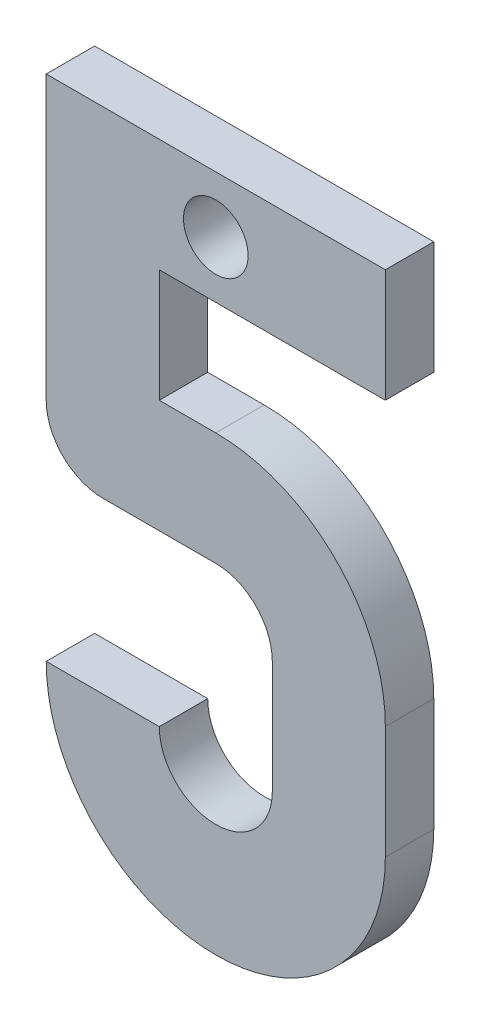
from build123d import *

# Parameters (mm, degrees)
SKETCH1_R      = 2
EXTRUDE1_DEPTH = 3


with BuildPart() as part:
    # Sketch1 → Extrude1 (new body)
    with BuildSketch(Plane.XY):
        with BuildLine():
            Line((21, 35), (21, 42))
            Line((21, 42), (0, 42))
            Line((0, 42), (0, 24.5))
            ThreePointArc((0, 24.5), (1.025126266, 22.025126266), (3.5, 21))
            Line((3.5, 21), (10.5, 21))
            ThreePointArc((10.5, 21), (12.974873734, 19.974873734), (14, 17.5))
            Line((14, 17.5), (14, 10.5))
            ThreePointArc((14, 10.5), (10.5, 7), (7, 10.5))
            Line((7, 10.5), (0, 10.5))
            ThreePointArc((0, 10.5), (10.5, 0), (21, 10.5))
            Line((21, 10.5), (21, 17.5))
            ThreePointArc((21, 17.5), (17.924621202, 24.924621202), (10.5, 28))
            Line((10.5, 28), (7, 28))
            Line((7, 28), (7, 35))
            Line((7, 35), (21, 35))
        make_face()
        with Locations((10.5, 38.5)):
            Circle(SKETCH1_R, mode=Mode.SUBTRACT)
    extrude(amount=EXTRUDE1_DEPTH)


solid = part.part
